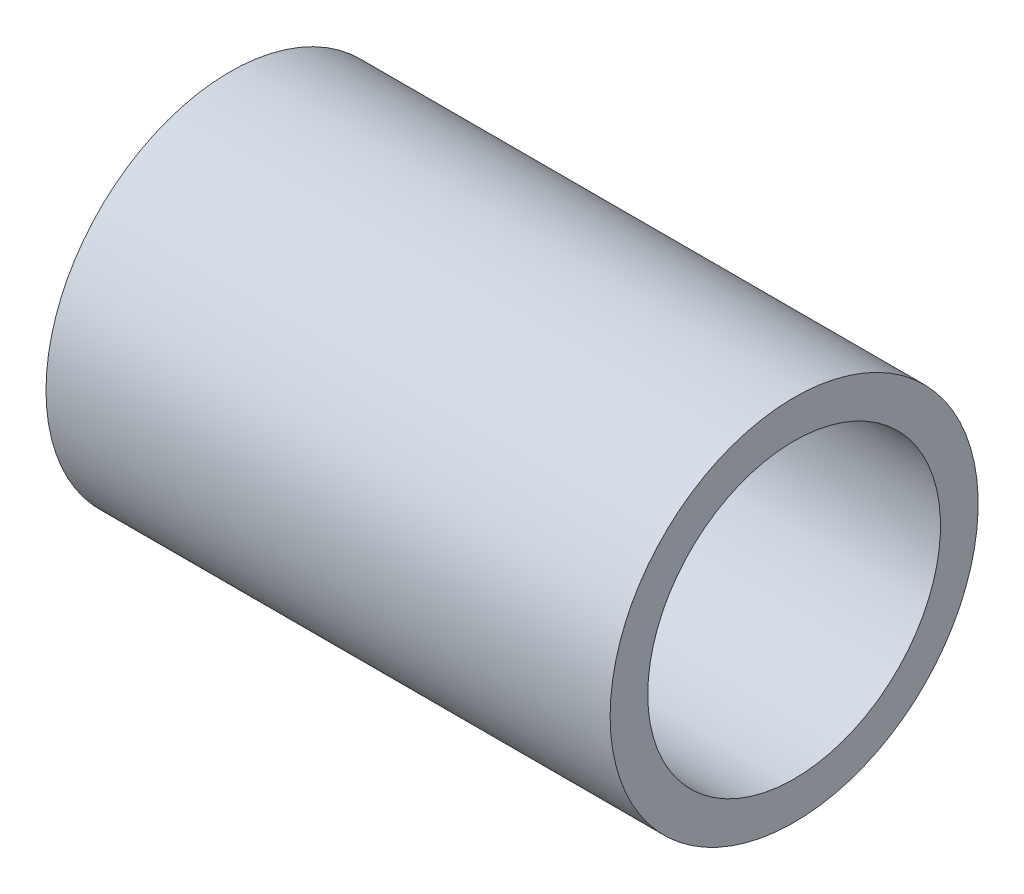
from build123d import *


with BuildPart() as part:
    # Sketch1 → Revolve1 (revolve)
    with BuildSketch(Plane.XY, mode=Mode.PRIVATE) as revolve1_sk:
        Polygon((-1.1938, -7.8994), (1.1938, -7.8994), (1.1938, -10.6172), (20.7518, -10.7696), (20.7518, -13.5382), (-20.7518, -13.5382), (-20.7518, -10.7696), (-1.1938, -10.6172), align=None)
    revolve(revolve1_sk.sketch.rotate(Axis((-20.7518, 0, 0), (1, 0, 0)), 270), axis=Axis((-20.7518, 0, 0), (1, 0, 0)))


solid = part.part
